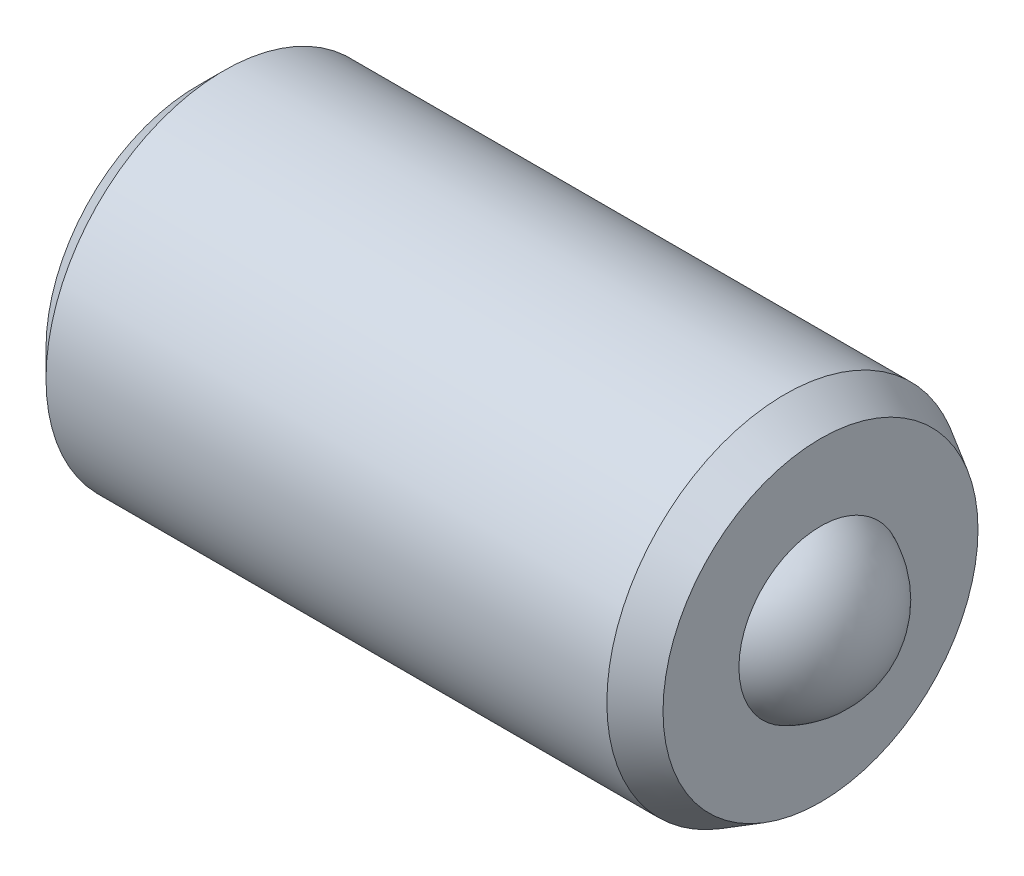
ISO-10303-21;
HEADER;
FILE_DESCRIPTION(('STEP AP214'),'2;1');
FILE_NAME('part.step','',(''),(''),'','','');
FILE_SCHEMA(('AUTOMOTIVE_DESIGN { 1 0 10303 214 1 1 1 1 }'));
ENDSEC;
DATA;
#1=APPLICATION_CONTEXT('core data for automotive mechanical design processes');
#2=APPLICATION_PROTOCOL_DEFINITION('international standard','automotive_design',2000,#1);
#3=PRODUCT_CONTEXT('',#1,'mechanical');
#4=PRODUCT('Part','Part','',(#3));
#5=PRODUCT_RELATED_PRODUCT_CATEGORY('part','',(#4));
#6=PRODUCT_DEFINITION_FORMATION('','',#4);
#7=PRODUCT_DEFINITION_CONTEXT('part definition',#1,'design');
#8=PRODUCT_DEFINITION('design','',#6,#7);
#9=PRODUCT_DEFINITION_SHAPE('','',#8);
#10=(LENGTH_UNIT() NAMED_UNIT(*) SI_UNIT(.MILLI.,.METRE.));
#11=(NAMED_UNIT(*) PLANE_ANGLE_UNIT() SI_UNIT($,.RADIAN.));
#12=(NAMED_UNIT(*) SI_UNIT($,.STERADIAN.) SOLID_ANGLE_UNIT());
#13=UNCERTAINTY_MEASURE_WITH_UNIT(LENGTH_MEASURE(1.E-05),#10,'distance_accuracy_value','');
#14=(GEOMETRIC_REPRESENTATION_CONTEXT(3) GLOBAL_UNCERTAINTY_ASSIGNED_CONTEXT((#13)) GLOBAL_UNIT_ASSIGNED_CONTEXT((#10,
#11,#12)) REPRESENTATION_CONTEXT('',''));
#15=CARTESIAN_POINT('',(0.,0.,0.));
#16=DIRECTION('',(0.,0.,1.));
#17=DIRECTION('',(1.,0.,0.));
#18=AXIS2_PLACEMENT_3D('',#15,#16,#17);
#19=CARTESIAN_POINT('',(3.3,0.,0.));
#20=DIRECTION('',(0.,-1.,0.));
#21=DIRECTION('',(-1.,0.,0.));
#22=AXIS2_PLACEMENT_3D('',#19,#20,#21);
#23=SPHERICAL_SURFACE('',#22,0.5);
#24=CARTESIAN_POINT('',(3.3,-0.5,0.));
#25=VERTEX_POINT('',#24);
#26=VERTEX_LOOP('',#25);
#27=FACE_BOUND('',#26,.T.);
#28=ADVANCED_FACE('P0_F11',(#27),#23,.T.);
#29=CLOSED_SHELL('',(#28));
#30=MANIFOLD_SOLID_BREP('P0_B1',#29);
#31=CARTESIAN_POINT('',(0.,0.,0.));
#32=DIRECTION('',(1.,0.,0.));
#33=DIRECTION('',(0.,0.,-1.));
#34=AXIS2_PLACEMENT_3D('',#31,#32,#33);
#35=PLANE('',#34);
#36=CARTESIAN_POINT('',(0.,0.,0.));
#37=DIRECTION('',(-1.,0.,0.));
#38=DIRECTION('',(0.,0.,1.));
#39=AXIS2_PLACEMENT_3D('',#36,#37,#38);
#40=CIRCLE('',#39,0.849999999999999);
#41=CARTESIAN_POINT('',(0.,0.,0.849999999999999));
#42=VERTEX_POINT('',#41);
#43=EDGE_CURVE('P1_E10',#42,#42,#40,.T.);
#44=ORIENTED_EDGE('',*,*,#43,.T.);
#45=EDGE_LOOP('',(#44));
#46=FACE_BOUND('',#45,.T.);
#47=ADVANCED_FACE('P1_F15',(#46),#35,.F.);
#48=CARTESIAN_POINT('',(0.15,0.,0.));
#49=DIRECTION('',(1.,0.,0.));
#50=DIRECTION('',(0.,0.,-1.));
#51=AXIS2_PLACEMENT_3D('',#48,#49,#50);
#52=CONICAL_SURFACE('',#51,1.,0.78539816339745);
#53=ORIENTED_EDGE('',*,*,#43,.F.);
#54=EDGE_LOOP('',(#53));
#55=FACE_BOUND('',#54,.T.);
#56=CARTESIAN_POINT('',(0.15,0.,0.));
#57=DIRECTION('',(-1.,0.,0.));
#58=DIRECTION('',(0.,0.,1.));
#59=AXIS2_PLACEMENT_3D('',#56,#57,#58);
#60=CIRCLE('',#59,1.);
#61=CARTESIAN_POINT('',(0.15,0.,1.));
#62=VERTEX_POINT('',#61);
#63=EDGE_CURVE('P1_E21',#62,#62,#60,.T.);
#64=ORIENTED_EDGE('',*,*,#63,.T.);
#65=EDGE_LOOP('',(#64));
#66=FACE_BOUND('',#65,.T.);
#67=ADVANCED_FACE('P1_F39',(#55,#66),#52,.T.);
#68=CARTESIAN_POINT('',(0.,0.,0.));
#69=DIRECTION('',(-1.,0.,0.));
#70=DIRECTION('',(0.,0.,1.));
#71=AXIS2_PLACEMENT_3D('',#68,#69,#70);
#72=CYLINDRICAL_SURFACE('',#71,1.);
#73=ORIENTED_EDGE('',*,*,#63,.F.);
#74=EDGE_LOOP('',(#73));
#75=FACE_BOUND('',#74,.T.);
#76=CARTESIAN_POINT('',(3.3,0.,0.));
#77=DIRECTION('',(-1.,0.,0.));
#78=DIRECTION('',(0.,0.,1.));
#79=AXIS2_PLACEMENT_3D('',#76,#77,#78);
#80=CIRCLE('',#79,1.);
#81=CARTESIAN_POINT('',(3.3,0.,1.));
#82=VERTEX_POINT('',#81);
#83=EDGE_CURVE('P1_E52',#82,#82,#80,.T.);
#84=ORIENTED_EDGE('',*,*,#83,.T.);
#85=EDGE_LOOP('',(#84));
#86=FACE_BOUND('',#85,.T.);
#87=ADVANCED_FACE('P1_F45',(#75,#86),#72,.T.);
#88=CARTESIAN_POINT('',(3.5,0.,0.));
#89=DIRECTION('',(-1.,0.,0.));
#90=DIRECTION('',(0.,0.,1.));
#91=AXIS2_PLACEMENT_3D('',#88,#89,#90);
#92=CONICAL_SURFACE('',#91,0.884529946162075,0.523598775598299);
#93=ORIENTED_EDGE('',*,*,#83,.F.);
#94=EDGE_LOOP('',(#93));
#95=FACE_BOUND('',#94,.T.);
#96=CARTESIAN_POINT('',(3.5,0.,0.));
#97=DIRECTION('',(-1.,0.,0.));
#98=DIRECTION('',(0.,0.,1.));
#99=AXIS2_PLACEMENT_3D('',#96,#97,#98);
#100=CIRCLE('',#99,0.884529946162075);
#101=CARTESIAN_POINT('',(3.5,0.,0.884529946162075));
#102=VERTEX_POINT('',#101);
#103=EDGE_CURVE('P1_E54',#102,#102,#100,.T.);
#104=ORIENTED_EDGE('',*,*,#103,.T.);
#105=EDGE_LOOP('',(#104));
#106=FACE_BOUND('',#105,.T.);
#107=ADVANCED_FACE('P1_F78',(#95,#106),#92,.T.);
#108=CARTESIAN_POINT('',(3.5,0.884529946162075,0.));
#109=DIRECTION('',(-1.,0.,0.));
#110=DIRECTION('',(0.,0.,1.));
#111=AXIS2_PLACEMENT_3D('',#108,#109,#110);
#112=PLANE('',#111);
#113=ORIENTED_EDGE('',*,*,#103,.F.);
#114=EDGE_LOOP('',(#113));
#115=FACE_BOUND('',#114,.T.);
#116=CARTESIAN_POINT('',(3.5,0.,0.));
#117=DIRECTION('',(-1.,0.,0.));
#118=DIRECTION('',(0.,0.,1.));
#119=AXIS2_PLACEMENT_3D('',#116,#117,#118);
#120=CIRCLE('',#119,0.458257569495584);
#121=CARTESIAN_POINT('',(3.5,0.,0.458257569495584));
#122=VERTEX_POINT('',#121);
#123=EDGE_CURVE('P1_E59',#122,#122,#120,.T.);
#124=ORIENTED_EDGE('',*,*,#123,.T.);
#125=EDGE_LOOP('',(#124));
#126=FACE_BOUND('',#125,.T.);
#127=ADVANCED_FACE('P1_F71',(#115,#126),#112,.F.);
#128=CARTESIAN_POINT('',(3.3,0.,0.));
#129=DIRECTION('',(-1.,0.,0.));
#130=DIRECTION('',(0.,1.,0.));
#131=AXIS2_PLACEMENT_3D('',#128,#129,#130);
#132=SPHERICAL_SURFACE('',#131,0.5);
#133=ORIENTED_EDGE('',*,*,#123,.F.);
#134=EDGE_LOOP('',(#133));
#135=FACE_BOUND('',#134,.T.);
#136=CARTESIAN_POINT('',(3.3,0.,0.));
#137=DIRECTION('',(-1.,0.,0.));
#138=DIRECTION('',(0.,0.,1.));
#139=AXIS2_PLACEMENT_3D('',#136,#137,#138);
#140=CIRCLE('',#139,0.5);
#141=CARTESIAN_POINT('',(3.3,0.,0.5));
#142=VERTEX_POINT('',#141);
#143=EDGE_CURVE('P1_E62',#142,#142,#140,.T.);
#144=ORIENTED_EDGE('',*,*,#143,.T.);
#145=EDGE_LOOP('',(#144));
#146=FACE_BOUND('',#145,.T.);
#147=ADVANCED_FACE('P1_F34',(#135,#146),#132,.F.);
#148=CARTESIAN_POINT('',(0.,0.,0.));
#149=DIRECTION('',(-1.,0.,0.));
#150=DIRECTION('',(0.,0.,1.));
#151=AXIS2_PLACEMENT_3D('',#148,#149,#150);
#152=CYLINDRICAL_SURFACE('',#151,0.5);
#153=ORIENTED_EDGE('',*,*,#143,.F.);
#154=EDGE_LOOP('',(#153));
#155=FACE_BOUND('',#154,.T.);
#156=CARTESIAN_POINT('',(1.03867513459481,0.,0.));
#157=DIRECTION('',(-1.,0.,0.));
#158=DIRECTION('',(0.,0.,1.));
#159=AXIS2_PLACEMENT_3D('',#156,#157,#158);
#160=CIRCLE('',#159,0.5);
#161=CARTESIAN_POINT('',(1.03867513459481,0.,0.5));
#162=VERTEX_POINT('',#161);
#163=EDGE_CURVE('P1_E65',#162,#162,#160,.T.);
#164=ORIENTED_EDGE('',*,*,#163,.T.);
#165=EDGE_LOOP('',(#164));
#166=FACE_BOUND('',#165,.T.);
#167=ADVANCED_FACE('P1_F26',(#155,#166),#152,.F.);
#168=CARTESIAN_POINT('',(0.75,0.,0.));
#169=DIRECTION('',(1.,0.,0.));
#170=DIRECTION('',(0.,0.,-1.));
#171=AXIS2_PLACEMENT_3D('',#168,#169,#170);
#172=CONICAL_SURFACE('',#171,0.,1.0471975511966);
#173=ORIENTED_EDGE('',*,*,#163,.F.);
#174=EDGE_LOOP('',(#173));
#175=FACE_BOUND('',#174,.T.);
#176=CARTESIAN_POINT('',(0.75,0.,0.));
#177=VERTEX_POINT('',#176);
#178=VERTEX_LOOP('',#177);
#179=FACE_BOUND('',#178,.T.);
#180=ADVANCED_FACE('P1_F24',(#175,#179),#172,.F.);
#181=CLOSED_SHELL('',(#47,#67,#87,#107,#127,#147,#167,#180));
#182=MANIFOLD_SOLID_BREP('P1_B1',#181);
#183=ADVANCED_BREP_SHAPE_REPRESENTATION('',(#18,#30,#182),#14);
#184=SHAPE_DEFINITION_REPRESENTATION(#9,#183);
ENDSEC;
END-ISO-10303-21;
